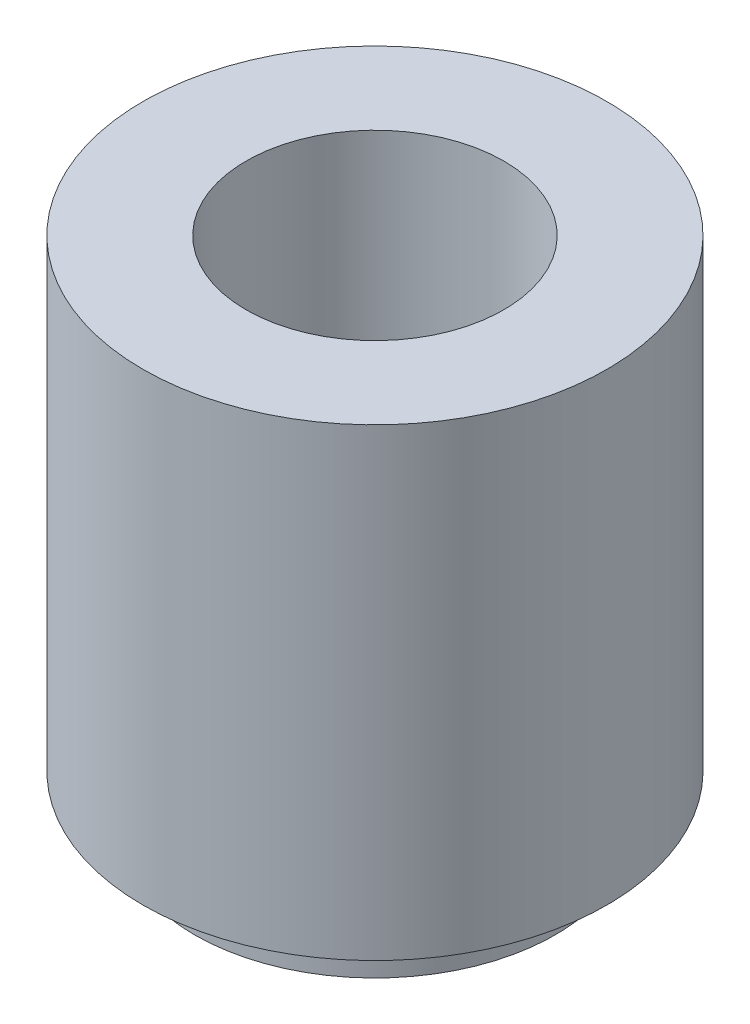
ISO-10303-21;
HEADER;
FILE_DESCRIPTION(('STEP AP214'),'2;1');
FILE_NAME('part.step','',(''),(''),'','','');
FILE_SCHEMA(('AUTOMOTIVE_DESIGN { 1 0 10303 214 1 1 1 1 }'));
ENDSEC;
DATA;
#1=APPLICATION_CONTEXT('core data for automotive mechanical design processes');
#2=APPLICATION_PROTOCOL_DEFINITION('international standard','automotive_design',2000,#1);
#3=PRODUCT_CONTEXT('',#1,'mechanical');
#4=PRODUCT('Part','Part','',(#3));
#5=PRODUCT_RELATED_PRODUCT_CATEGORY('part','',(#4));
#6=PRODUCT_DEFINITION_FORMATION('','',#4);
#7=PRODUCT_DEFINITION_CONTEXT('part definition',#1,'design');
#8=PRODUCT_DEFINITION('design','',#6,#7);
#9=PRODUCT_DEFINITION_SHAPE('','',#8);
#10=(LENGTH_UNIT() NAMED_UNIT(*) SI_UNIT(.MILLI.,.METRE.));
#11=(NAMED_UNIT(*) PLANE_ANGLE_UNIT() SI_UNIT($,.RADIAN.));
#12=(NAMED_UNIT(*) SI_UNIT($,.STERADIAN.) SOLID_ANGLE_UNIT());
#13=UNCERTAINTY_MEASURE_WITH_UNIT(LENGTH_MEASURE(1.E-05),#10,'distance_accuracy_value','');
#14=(GEOMETRIC_REPRESENTATION_CONTEXT(3) GLOBAL_UNCERTAINTY_ASSIGNED_CONTEXT((#13)) GLOBAL_UNIT_ASSIGNED_CONTEXT((#10,
#11,#12)) REPRESENTATION_CONTEXT('',''));
#15=CARTESIAN_POINT('',(0.,0.,0.));
#16=DIRECTION('',(0.,0.,1.));
#17=DIRECTION('',(1.,0.,0.));
#18=AXIS2_PLACEMENT_3D('',#15,#16,#17);
#19=CARTESIAN_POINT('',(4.5,-4.,0.));
#20=DIRECTION('',(0.,-1.,0.));
#21=DIRECTION('',(0.,0.,-1.));
#22=AXIS2_PLACEMENT_3D('',#19,#20,#21);
#23=PLANE('',#22);
#24=CARTESIAN_POINT('',(0.,-4.,0.));
#25=DIRECTION('',(0.,1.,0.));
#26=DIRECTION('',(0.,0.,1.));
#27=AXIS2_PLACEMENT_3D('',#24,#25,#26);
#28=CIRCLE('',#27,3.5);
#29=CARTESIAN_POINT('',(0.,-4.,3.5));
#30=VERTEX_POINT('',#29);
#31=EDGE_CURVE('E52',#30,#30,#28,.T.);
#32=ORIENTED_EDGE('',*,*,#31,.T.);
#33=EDGE_LOOP('',(#32));
#34=FACE_BOUND('',#33,.T.);
#35=CARTESIAN_POINT('',(0.,-4.,0.));
#36=DIRECTION('',(0.,1.,0.));
#37=DIRECTION('',(0.,0.,1.));
#38=AXIS2_PLACEMENT_3D('',#35,#36,#37);
#39=CIRCLE('',#38,4.5);
#40=CARTESIAN_POINT('',(0.,-4.,4.5));
#41=VERTEX_POINT('',#40);
#42=EDGE_CURVE('E10',#41,#41,#39,.T.);
#43=ORIENTED_EDGE('',*,*,#42,.F.);
#44=EDGE_LOOP('',(#43));
#45=FACE_BOUND('',#44,.T.);
#46=ADVANCED_FACE('F30',(#34,#45),#23,.T.);
#47=CARTESIAN_POINT('',(0.,-5.,0.));
#48=DIRECTION('',(0.,1.,0.));
#49=DIRECTION('',(0.,0.,1.));
#50=AXIS2_PLACEMENT_3D('',#47,#48,#49);
#51=CYLINDRICAL_SURFACE('',#50,4.5);
#52=ORIENTED_EDGE('',*,*,#42,.T.);
#53=EDGE_LOOP('',(#52));
#54=FACE_BOUND('',#53,.T.);
#55=CARTESIAN_POINT('',(0.,5.,0.));
#56=DIRECTION('',(0.,1.,0.));
#57=DIRECTION('',(0.,0.,1.));
#58=AXIS2_PLACEMENT_3D('',#55,#56,#57);
#59=CIRCLE('',#58,4.5);
#60=CARTESIAN_POINT('',(0.,5.,4.5));
#61=VERTEX_POINT('',#60);
#62=EDGE_CURVE('E36',#61,#61,#59,.T.);
#63=ORIENTED_EDGE('',*,*,#62,.F.);
#64=EDGE_LOOP('',(#63));
#65=FACE_BOUND('',#64,.T.);
#66=ADVANCED_FACE('F70',(#54,#65),#51,.T.);
#67=CARTESIAN_POINT('',(2.49999999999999,5.,0.));
#68=DIRECTION('',(0.,1.,0.));
#69=DIRECTION('',(0.,0.,1.));
#70=AXIS2_PLACEMENT_3D('',#67,#68,#69);
#71=PLANE('',#70);
#72=ORIENTED_EDGE('',*,*,#62,.T.);
#73=EDGE_LOOP('',(#72));
#74=FACE_BOUND('',#73,.T.);
#75=CARTESIAN_POINT('',(0.,5.,0.));
#76=DIRECTION('',(0.,1.,0.));
#77=DIRECTION('',(0.,0.,1.));
#78=AXIS2_PLACEMENT_3D('',#75,#76,#77);
#79=CIRCLE('',#78,2.49999999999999);
#80=CARTESIAN_POINT('',(0.,5.,2.49999999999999));
#81=VERTEX_POINT('',#80);
#82=EDGE_CURVE('E40',#81,#81,#79,.T.);
#83=ORIENTED_EDGE('',*,*,#82,.F.);
#84=EDGE_LOOP('',(#83));
#85=FACE_BOUND('',#84,.T.);
#86=ADVANCED_FACE('F74',(#74,#85),#71,.T.);
#87=CARTESIAN_POINT('',(0.,-5.,0.));
#88=DIRECTION('',(0.,1.,0.));
#89=DIRECTION('',(0.,0.,1.));
#90=AXIS2_PLACEMENT_3D('',#87,#88,#89);
#91=CYLINDRICAL_SURFACE('',#90,2.49999999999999);
#92=ORIENTED_EDGE('',*,*,#82,.T.);
#93=EDGE_LOOP('',(#92));
#94=FACE_BOUND('',#93,.T.);
#95=CARTESIAN_POINT('',(0.,-5.,0.));
#96=DIRECTION('',(0.,1.,0.));
#97=DIRECTION('',(0.,0.,1.));
#98=AXIS2_PLACEMENT_3D('',#95,#96,#97);
#99=CIRCLE('',#98,2.49999999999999);
#100=CARTESIAN_POINT('',(0.,-5.,2.49999999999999));
#101=VERTEX_POINT('',#100);
#102=EDGE_CURVE('E44',#101,#101,#99,.T.);
#103=ORIENTED_EDGE('',*,*,#102,.F.);
#104=EDGE_LOOP('',(#103));
#105=FACE_BOUND('',#104,.T.);
#106=ADVANCED_FACE('F66',(#94,#105),#91,.F.);
#107=CARTESIAN_POINT('',(3.5,-5.,0.));
#108=DIRECTION('',(0.,-1.,0.));
#109=DIRECTION('',(0.,0.,-1.));
#110=AXIS2_PLACEMENT_3D('',#107,#108,#109);
#111=PLANE('',#110);
#112=ORIENTED_EDGE('',*,*,#102,.T.);
#113=EDGE_LOOP('',(#112));
#114=FACE_BOUND('',#113,.T.);
#115=CARTESIAN_POINT('',(0.,-5.,0.));
#116=DIRECTION('',(0.,1.,0.));
#117=DIRECTION('',(0.,0.,1.));
#118=AXIS2_PLACEMENT_3D('',#115,#116,#117);
#119=CIRCLE('',#118,3.5);
#120=CARTESIAN_POINT('',(0.,-5.,3.5));
#121=VERTEX_POINT('',#120);
#122=EDGE_CURVE('E49',#121,#121,#119,.T.);
#123=ORIENTED_EDGE('',*,*,#122,.F.);
#124=EDGE_LOOP('',(#123));
#125=FACE_BOUND('',#124,.T.);
#126=ADVANCED_FACE('F60',(#114,#125),#111,.T.);
#127=CARTESIAN_POINT('',(0.,-5.,0.));
#128=DIRECTION('',(0.,1.,0.));
#129=DIRECTION('',(0.,0.,1.));
#130=AXIS2_PLACEMENT_3D('',#127,#128,#129);
#131=CYLINDRICAL_SURFACE('',#130,3.5);
#132=ORIENTED_EDGE('',*,*,#122,.T.);
#133=EDGE_LOOP('',(#132));
#134=FACE_BOUND('',#133,.T.);
#135=ORIENTED_EDGE('',*,*,#31,.F.);
#136=EDGE_LOOP('',(#135));
#137=FACE_BOUND('',#136,.T.);
#138=ADVANCED_FACE('F58',(#134,#137),#131,.T.);
#139=CLOSED_SHELL('',(#46,#66,#86,#106,#126,#138));
#140=MANIFOLD_SOLID_BREP('B2',#139);
#141=ADVANCED_BREP_SHAPE_REPRESENTATION('',(#18,#140),#14);
#142=SHAPE_DEFINITION_REPRESENTATION(#9,#141);
ENDSEC;
END-ISO-10303-21;
